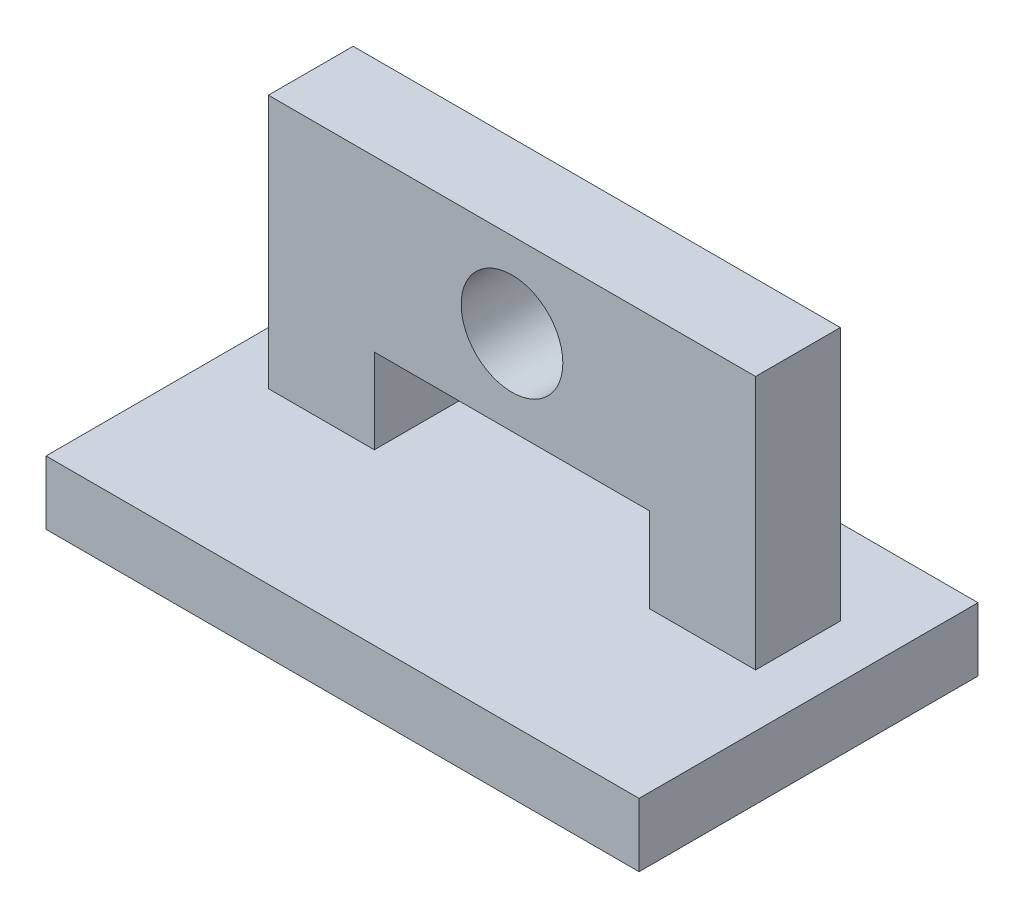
from build123d import *

# Parameters (mm, degrees)
SKETCH_1_W          = 140
SKETCH_1_H          = 80
EXTRUDE_1_DEPTH     = 15
SKETCH_2_W          = 25
SKETCH_2_H          = 60
EXTRUDE_2_DEPTH     = 20
SKETCH_3_W          = 25
SKETCH_3_H          = 60
EXTRUDE_3_DEPTH     = 20
SKETCH_4_W          = 70
SKETCH_4_H          = 40
EXTRUDE_4_DEPTH     = 20
SKETCH_5_R          = 12
CUT_EXTRUDE_1_DEPTH = 20


with BuildPart() as part:
    # Sketch 1 → Extrude 1 (new body)
    with BuildSketch(Plane(origin=(0, 0, 0), x_dir=(1, 0, 0), z_dir=(0, 1, 0))):
        Rectangle(SKETCH_1_W, SKETCH_1_H)
    extrude(amount=-EXTRUDE_1_DEPTH)

    # Sketch 2 → Extrude 2 (add)
    with BuildSketch(Plane.XY):
        with Locations((-45, 30)):
            Rectangle(SKETCH_2_W, SKETCH_2_H)
    extrude(amount=-EXTRUDE_2_DEPTH)

    # Sketch 3 → Extrude 3 (add)
    with BuildSketch(Plane.XY):
        with Locations((45, 30)):
            Rectangle(SKETCH_3_W, SKETCH_3_H)
    extrude(amount=-EXTRUDE_3_DEPTH)

    # Sketch 4 → Extrude 4 (add)
    with BuildSketch(Plane.XY):
        with Locations((0, 40)):
            Rectangle(SKETCH_4_W, SKETCH_4_H)
    extrude(amount=-EXTRUDE_4_DEPTH)

    # Sketch 5 → Cut-Extrude 1 (cut)
    with BuildSketch(Plane.XY):
        with Locations((0, 40)):
            Circle(SKETCH_5_R)
    extrude(amount=-CUT_EXTRUDE_1_DEPTH, mode=Mode.SUBTRACT)


solid = part.part
